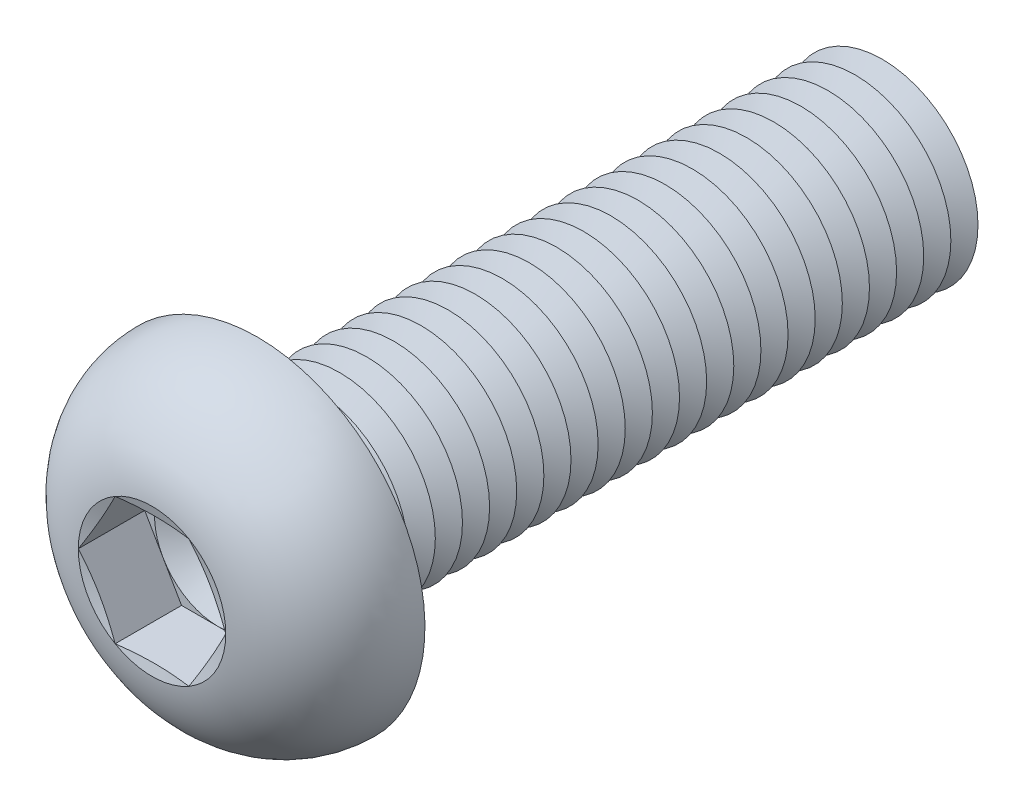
from build123d import *

# Parameters (mm, degrees)
FILLET1_R          = 0.85
LPATTERN1_COUNT    = 23
LPATTERN1_PITCH    = 1.7
CUT_EXTRUDE1_DEPTH = 4.16


with BuildPart() as part:
    # Sketch1 → Revolve1 (revolve)
    with BuildSketch(Plane(origin=(0, 0, 0), x_dir=(0, 0, -1), z_dir=(1, 0, 0))):
        with BuildLine():
            Line((0, 6), (0, 10.5))
            ThreePointArc((0, 10.5), (-4.420082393, 8.816378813), (-6.6, 4.6188))
            Line((-6.6, 4.6188), (-5.981198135, 2.3094))
            Line((-5.981198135, 2.3094), (-6.6, 2.3094))
            Line((-6.6, 2.3094), (-6.6, 0))
            Line((-6.6, 0), (40, 0))
            Line((40, 0), (40, 6))
            Line((40, 6), (0, 6))
        make_face()
    revolve(axis=Axis((0, 0, -40), (0, 0, 1)))

    # Fillet1
    fillet1_edges = [part.edges().sort_by_distance(p)[0] for p in [
        (0, -6, 0),
    ]]
    fillet(fillet1_edges, radius=FILLET1_R)

    # Sketch2 → Cut-Revolve1 (revolve, cut)
    with BuildSketch(Plane(origin=(0, 0, 0), x_dir=(0, 0, -1), z_dir=(1, 0, 0))):
        Polygon((39.15, 6), (40.85, 6), (40, 4.527756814), align=None)
    cut_revolve1 = revolve(axis=Axis((0, 0, -40), (0, 0, -1)), mode=Mode.SUBTRACT)

    # LPattern1: Cut-Revolve1 ×23
    with Locations(*[(0, 0, i * LPATTERN1_PITCH) for i in range(1, LPATTERN1_COUNT)]):
        add(cut_revolve1, mode=Mode.SUBTRACT)

    # Sketch3 → Cut-Extrude1 (cut)
    with BuildSketch(Plane.XY.offset(6.6)):
        Polygon((2.3094, 3.999998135), (-2.3094, 3.999998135), (-4.6188, 0), (-2.3094, -3.999998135), (2.3094, -3.999998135), (4.6188, 0), align=None)
    extrude(amount=-CUT_EXTRUDE1_DEPTH, mode=Mode.SUBTRACT)

    # Cut-Extrude2 cone 1 section (on through the dimple's axis) → Cut-Extrude2 (revolve, cut)
    with BuildSketch(Plane(origin=(0, 0, 2.44), x_dir=(0, -1, 0), z_dir=(1, 0, 0))):
        Polygon((0, 0), (3.999998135, 0), (0, 2.3094), align=None)
    revolve(axis=Axis((0, 0, 2.44), (0, 0, -1)), mode=Mode.SUBTRACT)


solid = part.part
